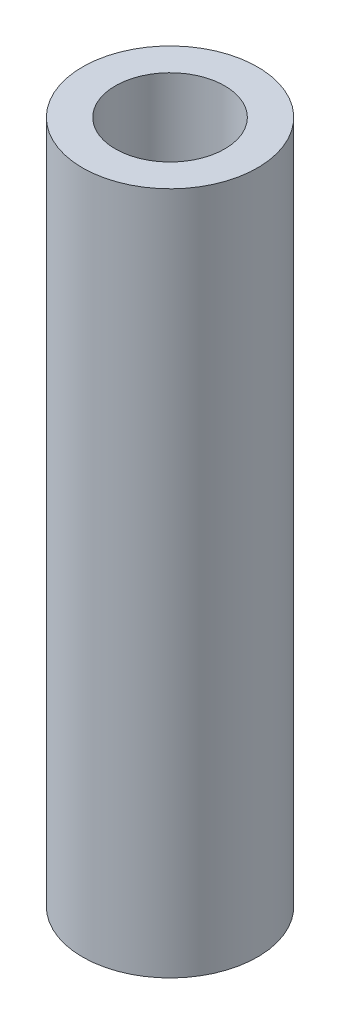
ISO-10303-21;
HEADER;
FILE_DESCRIPTION(('STEP AP214'),'2;1');
FILE_NAME('part.step','',(''),(''),'','','');
FILE_SCHEMA(('AUTOMOTIVE_DESIGN { 1 0 10303 214 1 1 1 1 }'));
ENDSEC;
DATA;
#1=APPLICATION_CONTEXT('core data for automotive mechanical design processes');
#2=APPLICATION_PROTOCOL_DEFINITION('international standard','automotive_design',2000,#1);
#3=PRODUCT_CONTEXT('',#1,'mechanical');
#4=PRODUCT('Part','Part','',(#3));
#5=PRODUCT_RELATED_PRODUCT_CATEGORY('part','',(#4));
#6=PRODUCT_DEFINITION_FORMATION('','',#4);
#7=PRODUCT_DEFINITION_CONTEXT('part definition',#1,'design');
#8=PRODUCT_DEFINITION('design','',#6,#7);
#9=PRODUCT_DEFINITION_SHAPE('','',#8);
#10=(LENGTH_UNIT() NAMED_UNIT(*) SI_UNIT(.MILLI.,.METRE.));
#11=(NAMED_UNIT(*) PLANE_ANGLE_UNIT() SI_UNIT($,.RADIAN.));
#12=(NAMED_UNIT(*) SI_UNIT($,.STERADIAN.) SOLID_ANGLE_UNIT());
#13=UNCERTAINTY_MEASURE_WITH_UNIT(LENGTH_MEASURE(1.E-05),#10,'distance_accuracy_value','');
#14=(GEOMETRIC_REPRESENTATION_CONTEXT(3) GLOBAL_UNCERTAINTY_ASSIGNED_CONTEXT((#13)) GLOBAL_UNIT_ASSIGNED_CONTEXT((#10,
#11,#12)) REPRESENTATION_CONTEXT('',''));
#15=CARTESIAN_POINT('',(0.,0.,0.));
#16=DIRECTION('',(0.,0.,1.));
#17=DIRECTION('',(1.,0.,0.));
#18=AXIS2_PLACEMENT_3D('',#15,#16,#17);
#19=CARTESIAN_POINT('',(0.,31.,0.));
#20=DIRECTION('',(0.,1.,0.));
#21=DIRECTION('',(0.,0.,1.));
#22=AXIS2_PLACEMENT_3D('',#19,#20,#21);
#23=PLANE('',#22);
#24=CARTESIAN_POINT('',(0.,31.,0.));
#25=DIRECTION('',(0.,1.,0.));
#26=DIRECTION('',(0.,0.,1.));
#27=AXIS2_PLACEMENT_3D('',#24,#25,#26);
#28=CIRCLE('',#27,3.96875);
#29=CARTESIAN_POINT('',(0.,31.,3.96875));
#30=VERTEX_POINT('',#29);
#31=EDGE_CURVE('E10',#30,#30,#28,.T.);
#32=ORIENTED_EDGE('',*,*,#31,.T.);
#33=EDGE_LOOP('',(#32));
#34=FACE_BOUND('',#33,.T.);
#35=CARTESIAN_POINT('',(0.,31.,0.));
#36=DIRECTION('',(0.,1.,0.));
#37=DIRECTION('',(0.,0.,1.));
#38=AXIS2_PLACEMENT_3D('',#35,#36,#37);
#39=CIRCLE('',#38,2.48125);
#40=CARTESIAN_POINT('',(0.,31.,2.48125));
#41=VERTEX_POINT('',#40);
#42=EDGE_CURVE('E54',#41,#41,#39,.T.);
#43=ORIENTED_EDGE('',*,*,#42,.F.);
#44=EDGE_LOOP('',(#43));
#45=FACE_BOUND('',#44,.T.);
#46=ADVANCED_FACE('F41',(#34,#45),#23,.T.);
#47=CARTESIAN_POINT('',(0.,0.,0.));
#48=DIRECTION('',(0.,1.,0.));
#49=DIRECTION('',(0.,0.,1.));
#50=AXIS2_PLACEMENT_3D('',#47,#48,#49);
#51=PLANE('',#50);
#52=CARTESIAN_POINT('',(0.,0.,0.));
#53=DIRECTION('',(0.,1.,0.));
#54=DIRECTION('',(0.,0.,1.));
#55=AXIS2_PLACEMENT_3D('',#52,#53,#54);
#56=CIRCLE('',#55,3.96875);
#57=CARTESIAN_POINT('',(0.,0.,3.96875));
#58=VERTEX_POINT('',#57);
#59=EDGE_CURVE('E45',#58,#58,#56,.T.);
#60=ORIENTED_EDGE('',*,*,#59,.F.);
#61=EDGE_LOOP('',(#60));
#62=FACE_BOUND('',#61,.T.);
#63=CARTESIAN_POINT('',(0.,0.,0.));
#64=DIRECTION('',(0.,1.,0.));
#65=DIRECTION('',(0.,0.,1.));
#66=AXIS2_PLACEMENT_3D('',#63,#64,#65);
#67=CIRCLE('',#66,2.48125);
#68=CARTESIAN_POINT('',(0.,0.,2.48125));
#69=VERTEX_POINT('',#68);
#70=EDGE_CURVE('E56',#69,#69,#67,.T.);
#71=ORIENTED_EDGE('',*,*,#70,.T.);
#72=EDGE_LOOP('',(#71));
#73=FACE_BOUND('',#72,.T.);
#74=ADVANCED_FACE('F68',(#62,#73),#51,.F.);
#75=CARTESIAN_POINT('',(0.,31.,0.));
#76=DIRECTION('',(0.,-1.,0.));
#77=DIRECTION('',(0.,0.,-1.));
#78=AXIS2_PLACEMENT_3D('',#75,#76,#77);
#79=CYLINDRICAL_SURFACE('',#78,3.96875);
#80=ORIENTED_EDGE('',*,*,#31,.F.);
#81=EDGE_LOOP('',(#80));
#82=FACE_BOUND('',#81,.T.);
#83=ORIENTED_EDGE('',*,*,#59,.T.);
#84=EDGE_LOOP('',(#83));
#85=FACE_BOUND('',#84,.T.);
#86=ADVANCED_FACE('F43',(#82,#85),#79,.T.);
#87=CARTESIAN_POINT('',(0.,31.,0.));
#88=DIRECTION('',(0.,-1.,0.));
#89=DIRECTION('',(0.,0.,-1.));
#90=AXIS2_PLACEMENT_3D('',#87,#88,#89);
#91=CYLINDRICAL_SURFACE('',#90,2.48125);
#92=ORIENTED_EDGE('',*,*,#42,.T.);
#93=EDGE_LOOP('',(#92));
#94=FACE_BOUND('',#93,.T.);
#95=ORIENTED_EDGE('',*,*,#70,.F.);
#96=EDGE_LOOP('',(#95));
#97=FACE_BOUND('',#96,.T.);
#98=ADVANCED_FACE('F64',(#94,#97),#91,.F.);
#99=CLOSED_SHELL('',(#46,#74,#86,#98));
#100=MANIFOLD_SOLID_BREP('B2',#99);
#101=ADVANCED_BREP_SHAPE_REPRESENTATION('',(#18,#100),#14);
#102=SHAPE_DEFINITION_REPRESENTATION(#9,#101);
ENDSEC;
END-ISO-10303-21;
